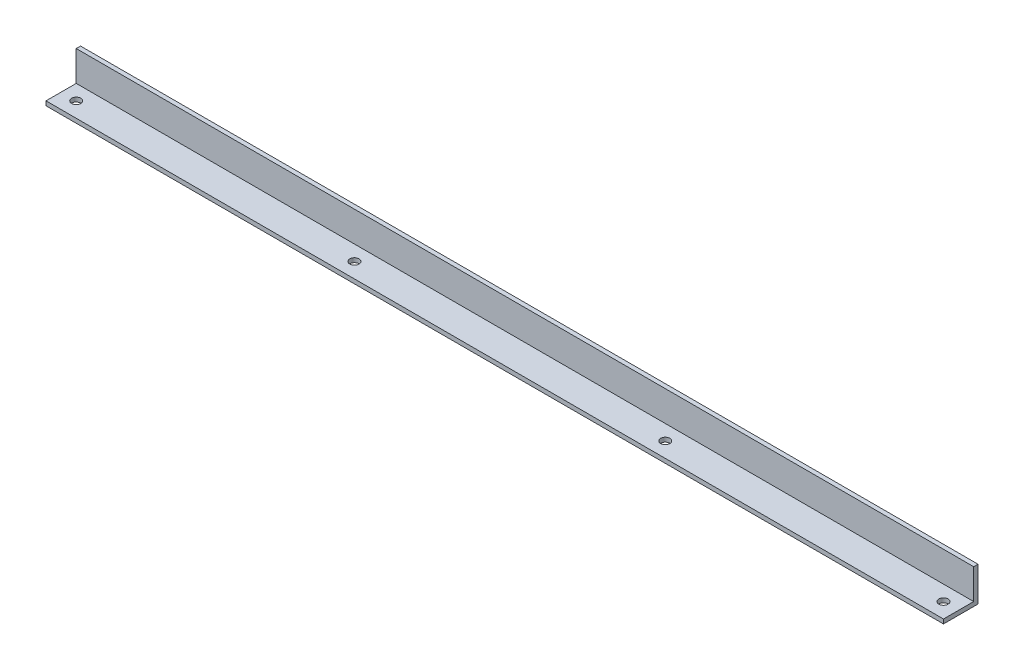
from build123d import *

# Parameters (mm, degrees)
SKETCH1_W           = 660.4
SKETCH1_H           = 25.4
BOSS_EXTRUDE1_DEPTH = 3.175
SKETCH2_W           = 660.4
SKETCH2_H           = 3.175
BOSS_EXTRUDE2_DEPTH = 22.225
SKETCH3_R           = 3.3782
CUT_EXTRUDE1_DEPTH  = 332.190701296


with BuildPart() as part:
    # Sketch1 → Boss-Extrude1 (new body)
    with BuildSketch(Plane(origin=(0, 0, 0), x_dir=(1, 0, 0), z_dir=(0, 1, 0))):
        Rectangle(SKETCH1_W, SKETCH1_H)
    extrude(amount=BOSS_EXTRUDE1_DEPTH)

    # Sketch2 → Boss-Extrude2 (add)
    with BuildSketch(Plane(origin=(0, 3.175, 0), x_dir=(1, 0, 0), z_dir=(0, 1, 0))):
        with Locations((0, 11.1125)):
            Rectangle(SKETCH2_W, SKETCH2_H)
    extrude(amount=BOSS_EXTRUDE2_DEPTH)

    # Sketch3 → Cut-Extrude1 (cut, through all)
    with BuildSketch(Plane(origin=(0, 3.175, 0), x_dir=(1, 0, 0), z_dir=(0, 1, 0))):
        with Locations(Location((-319.0875, -1.5875, 0), (0, 0, 270))):
            Circle(SKETCH3_R)
        with Locations(Location((-114.3635, -1.5875, 0), (0, 0, 270))):
            Circle(SKETCH3_R)
        with Locations(Location((319.0875, -1.5875, 0), (0, 0, 270))):
            Circle(SKETCH3_R)
        with Locations(Location((114.3635, -1.5875, 0), (0, 0, 270))):
            Circle(SKETCH3_R)
    extrude(amount=-CUT_EXTRUDE1_DEPTH, mode=Mode.SUBTRACT)


solid = part.part
